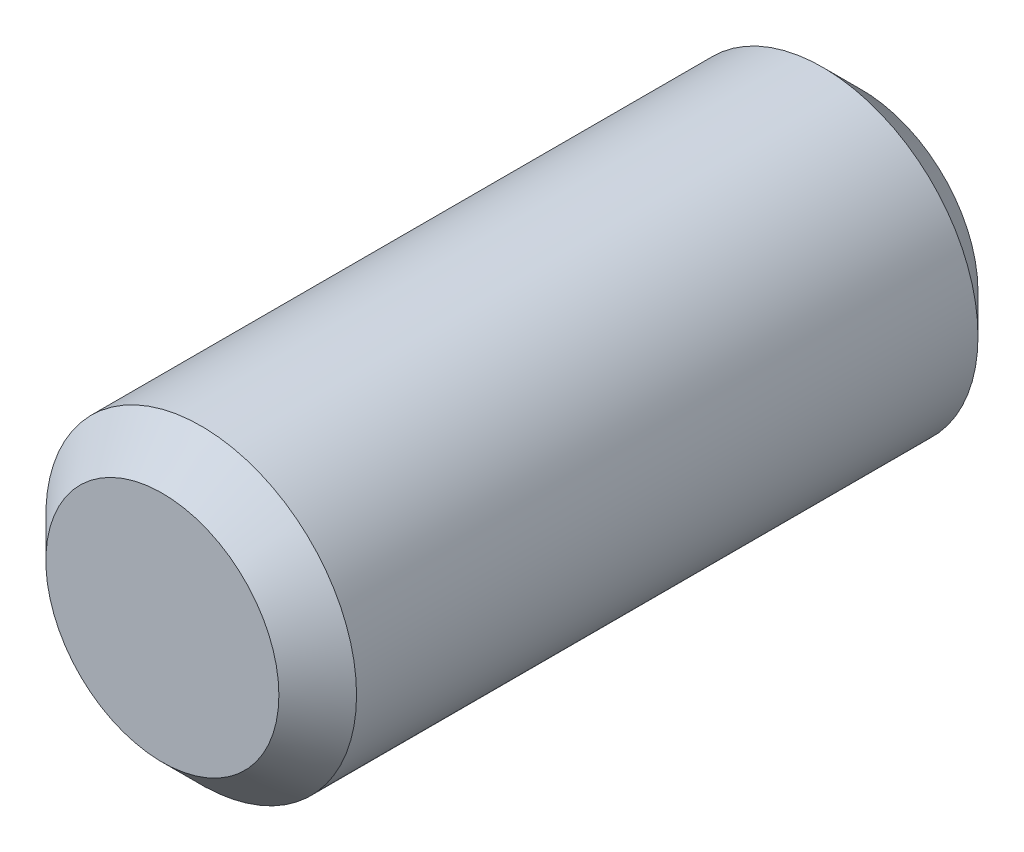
from build123d import *

# Parameters (mm, degrees)
ESQUISSE1_R      = 2
EXTRUSION1_DEPTH = 9
CHANFREIN1_SIZE  = 0.5


with BuildPart() as part:
    # Esquisse1 → Extrusion1 (new body)
    with BuildSketch(Plane.XY):
        Circle(ESQUISSE1_R)
    extrude(amount=EXTRUSION1_DEPTH)

    # Chanfrein1
    chanfrein1_edges = [part.edges().sort_by_distance(p)[0] for p in [
        (-2, 0, 0),
        (-2, 0, 9),
    ]]
    chamfer(chanfrein1_edges, length=CHANFREIN1_SIZE)


solid = part.part
